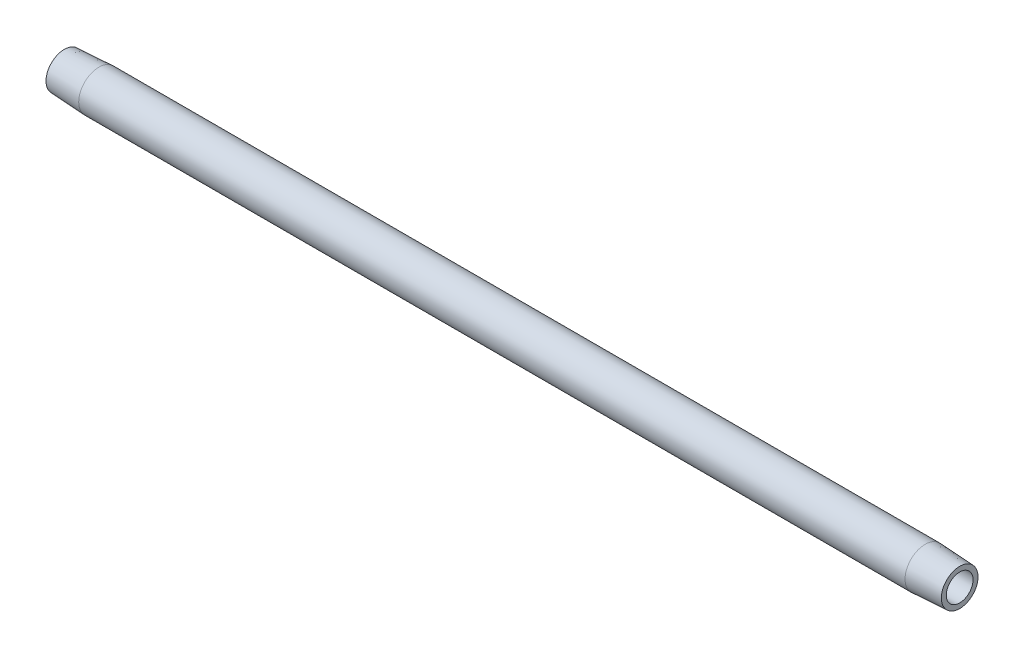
ISO-10303-21;
HEADER;
FILE_DESCRIPTION(('STEP AP214'),'2;1');
FILE_NAME('part.step','',(''),(''),'','','');
FILE_SCHEMA(('AUTOMOTIVE_DESIGN { 1 0 10303 214 1 1 1 1 }'));
ENDSEC;
DATA;
#1=APPLICATION_CONTEXT('core data for automotive mechanical design processes');
#2=APPLICATION_PROTOCOL_DEFINITION('international standard','automotive_design',2000,#1);
#3=PRODUCT_CONTEXT('',#1,'mechanical');
#4=PRODUCT('Part','Part','',(#3));
#5=PRODUCT_RELATED_PRODUCT_CATEGORY('part','',(#4));
#6=PRODUCT_DEFINITION_FORMATION('','',#4);
#7=PRODUCT_DEFINITION_CONTEXT('part definition',#1,'design');
#8=PRODUCT_DEFINITION('design','',#6,#7);
#9=PRODUCT_DEFINITION_SHAPE('','',#8);
#10=(LENGTH_UNIT() NAMED_UNIT(*) SI_UNIT(.MILLI.,.METRE.));
#11=(NAMED_UNIT(*) PLANE_ANGLE_UNIT() SI_UNIT($,.RADIAN.));
#12=(NAMED_UNIT(*) SI_UNIT($,.STERADIAN.) SOLID_ANGLE_UNIT());
#13=UNCERTAINTY_MEASURE_WITH_UNIT(LENGTH_MEASURE(1.E-05),#10,'distance_accuracy_value','');
#14=(GEOMETRIC_REPRESENTATION_CONTEXT(3) GLOBAL_UNCERTAINTY_ASSIGNED_CONTEXT((#13)) GLOBAL_UNIT_ASSIGNED_CONTEXT((#10,
#11,#12)) REPRESENTATION_CONTEXT('',''));
#15=CARTESIAN_POINT('',(0.,0.,0.));
#16=DIRECTION('',(0.,0.,1.));
#17=DIRECTION('',(1.,0.,0.));
#18=AXIS2_PLACEMENT_3D('',#15,#16,#17);
#19=CARTESIAN_POINT('',(0.476141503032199,0.,0.));
#20=DIRECTION('',(-1.,0.,0.));
#21=DIRECTION('',(0.,0.,1.));
#22=AXIS2_PLACEMENT_3D('',#19,#20,#21);
#23=CYLINDRICAL_SURFACE('',#22,5.14349999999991);
#24=CARTESIAN_POINT('',(8.8100393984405,0.,0.));
#25=DIRECTION('',(-1.,0.,0.));
#26=DIRECTION('',(0.,0.,1.));
#27=AXIS2_PLACEMENT_3D('',#24,#25,#26);
#28=CIRCLE('',#27,5.14349999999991);
#29=CARTESIAN_POINT('',(8.8100393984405,0.,5.14349999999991));
#30=VERTEX_POINT('',#29);
#31=EDGE_CURVE('E10',#30,#30,#28,.T.);
#32=ORIENTED_EDGE('',*,*,#31,.F.);
#33=EDGE_LOOP('',(#32));
#34=FACE_BOUND('',#33,.T.);
#35=CARTESIAN_POINT('',(219.789960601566,0.,0.));
#36=DIRECTION('',(-1.,0.,0.));
#37=DIRECTION('',(0.,0.,1.));
#38=AXIS2_PLACEMENT_3D('',#35,#36,#37);
#39=CIRCLE('',#38,5.14349999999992);
#40=CARTESIAN_POINT('',(219.789960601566,0.,5.14349999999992));
#41=VERTEX_POINT('',#40);
#42=EDGE_CURVE('E52',#41,#41,#39,.T.);
#43=ORIENTED_EDGE('',*,*,#42,.T.);
#44=EDGE_LOOP('',(#43));
#45=FACE_BOUND('',#44,.T.);
#46=ADVANCED_FACE('F30',(#34,#45),#23,.T.);
#47=CARTESIAN_POINT('',(8.8100393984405,0.,0.));
#48=DIRECTION('',(1.,0.,0.));
#49=DIRECTION('',(0.,0.,-1.));
#50=AXIS2_PLACEMENT_3D('',#47,#48,#49);
#51=CONICAL_SURFACE('',#50,5.14349999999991,0.0523598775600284);
#52=CARTESIAN_POINT('',(0.,0.,0.));
#53=DIRECTION('',(-1.,0.,0.));
#54=DIRECTION('',(0.,0.,1.));
#55=AXIS2_PLACEMENT_3D('',#52,#53,#54);
#56=CIRCLE('',#55,4.68178539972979);
#57=CARTESIAN_POINT('',(0.,0.,4.68178539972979));
#58=VERTEX_POINT('',#57);
#59=EDGE_CURVE('E36',#58,#58,#56,.T.);
#60=ORIENTED_EDGE('',*,*,#59,.F.);
#61=EDGE_LOOP('',(#60));
#62=FACE_BOUND('',#61,.T.);
#63=ORIENTED_EDGE('',*,*,#31,.T.);
#64=EDGE_LOOP('',(#63));
#65=FACE_BOUND('',#64,.T.);
#66=ADVANCED_FACE('F77',(#62,#65),#51,.T.);
#67=CARTESIAN_POINT('',(0.,4.68178539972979,0.));
#68=DIRECTION('',(1.,0.,0.));
#69=DIRECTION('',(0.,0.,-1.));
#70=AXIS2_PLACEMENT_3D('',#67,#68,#69);
#71=PLANE('',#70);
#72=CARTESIAN_POINT('',(0.,0.,0.));
#73=DIRECTION('',(-1.,0.,0.));
#74=DIRECTION('',(0.,0.,1.));
#75=AXIS2_PLACEMENT_3D('',#72,#73,#74);
#76=CIRCLE('',#75,3.4163);
#77=CARTESIAN_POINT('',(0.,0.,3.4163));
#78=VERTEX_POINT('',#77);
#79=EDGE_CURVE('E40',#78,#78,#76,.T.);
#80=ORIENTED_EDGE('',*,*,#79,.F.);
#81=EDGE_LOOP('',(#80));
#82=FACE_BOUND('',#81,.T.);
#83=ORIENTED_EDGE('',*,*,#59,.T.);
#84=EDGE_LOOP('',(#83));
#85=FACE_BOUND('',#84,.T.);
#86=ADVANCED_FACE('F72',(#82,#85),#71,.F.);
#87=CARTESIAN_POINT('',(0.476141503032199,0.,0.));
#88=DIRECTION('',(-1.,0.,0.));
#89=DIRECTION('',(0.,0.,1.));
#90=AXIS2_PLACEMENT_3D('',#87,#88,#89);
#91=CYLINDRICAL_SURFACE('',#90,3.4163);
#92=CARTESIAN_POINT('',(228.6,0.,0.));
#93=DIRECTION('',(-1.,0.,0.));
#94=DIRECTION('',(0.,0.,1.));
#95=AXIS2_PLACEMENT_3D('',#92,#93,#94);
#96=CIRCLE('',#95,3.41630000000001);
#97=CARTESIAN_POINT('',(228.6,0.,3.41630000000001));
#98=VERTEX_POINT('',#97);
#99=EDGE_CURVE('E44',#98,#98,#96,.T.);
#100=ORIENTED_EDGE('',*,*,#99,.F.);
#101=EDGE_LOOP('',(#100));
#102=FACE_BOUND('',#101,.T.);
#103=ORIENTED_EDGE('',*,*,#79,.T.);
#104=EDGE_LOOP('',(#103));
#105=FACE_BOUND('',#104,.T.);
#106=ADVANCED_FACE('F66',(#102,#105),#91,.F.);
#107=CARTESIAN_POINT('',(228.6,3.41630000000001,0.));
#108=DIRECTION('',(-1.,0.,0.));
#109=DIRECTION('',(0.,0.,1.));
#110=AXIS2_PLACEMENT_3D('',#107,#108,#109);
#111=PLANE('',#110);
#112=CARTESIAN_POINT('',(228.6,0.,0.));
#113=DIRECTION('',(-1.,0.,0.));
#114=DIRECTION('',(0.,0.,1.));
#115=AXIS2_PLACEMENT_3D('',#112,#113,#114);
#116=CIRCLE('',#115,4.68178539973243);
#117=CARTESIAN_POINT('',(228.6,0.,4.68178539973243));
#118=VERTEX_POINT('',#117);
#119=EDGE_CURVE('E49',#118,#118,#116,.T.);
#120=ORIENTED_EDGE('',*,*,#119,.F.);
#121=EDGE_LOOP('',(#120));
#122=FACE_BOUND('',#121,.T.);
#123=ORIENTED_EDGE('',*,*,#99,.T.);
#124=EDGE_LOOP('',(#123));
#125=FACE_BOUND('',#124,.T.);
#126=ADVANCED_FACE('F60',(#122,#125),#111,.F.);
#127=CARTESIAN_POINT('',(228.6,0.,0.));
#128=DIRECTION('',(-1.,0.,0.));
#129=DIRECTION('',(0.,0.,1.));
#130=AXIS2_PLACEMENT_3D('',#127,#128,#129);
#131=CONICAL_SURFACE('',#130,4.68178539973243,0.0523598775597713);
#132=ORIENTED_EDGE('',*,*,#42,.F.);
#133=EDGE_LOOP('',(#132));
#134=FACE_BOUND('',#133,.T.);
#135=ORIENTED_EDGE('',*,*,#119,.T.);
#136=EDGE_LOOP('',(#135));
#137=FACE_BOUND('',#136,.T.);
#138=ADVANCED_FACE('F57',(#134,#137),#131,.T.);
#139=CLOSED_SHELL('',(#46,#66,#86,#106,#126,#138));
#140=MANIFOLD_SOLID_BREP('B2',#139);
#141=ADVANCED_BREP_SHAPE_REPRESENTATION('',(#18,#140),#14);
#142=SHAPE_DEFINITION_REPRESENTATION(#9,#141);
ENDSEC;
END-ISO-10303-21;
